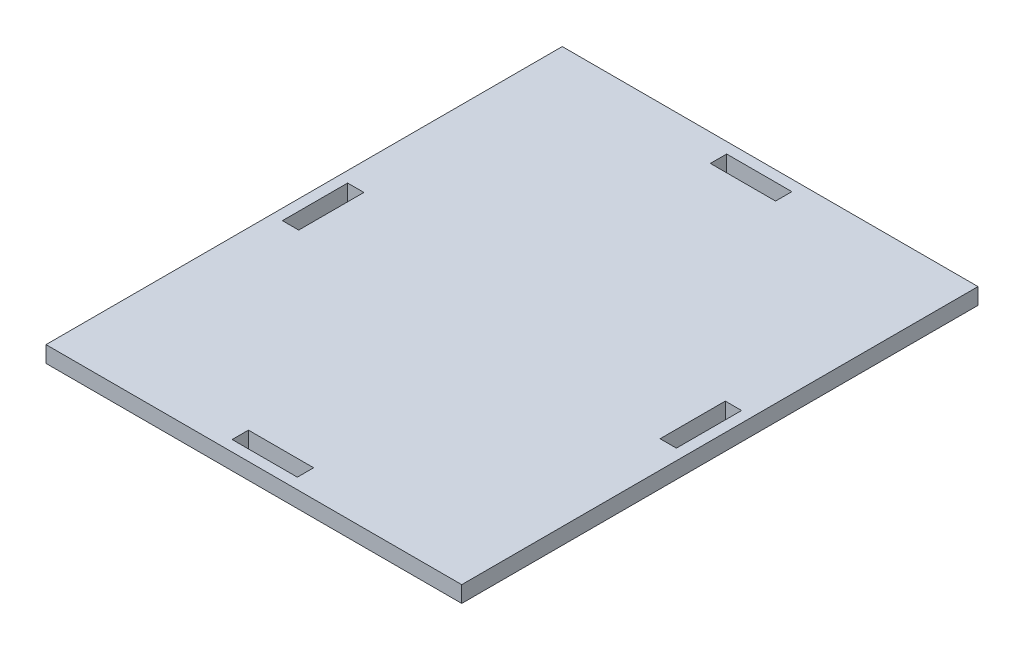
ISO-10303-21;
HEADER;
FILE_DESCRIPTION(('STEP AP214'),'2;1');
FILE_NAME('part.step','',(''),(''),'','','');
FILE_SCHEMA(('AUTOMOTIVE_DESIGN { 1 0 10303 214 1 1 1 1 }'));
ENDSEC;
DATA;
#1=APPLICATION_CONTEXT('core data for automotive mechanical design processes');
#2=APPLICATION_PROTOCOL_DEFINITION('international standard','automotive_design',2000,#1);
#3=PRODUCT_CONTEXT('',#1,'mechanical');
#4=PRODUCT('Part','Part','',(#3));
#5=PRODUCT_RELATED_PRODUCT_CATEGORY('part','',(#4));
#6=PRODUCT_DEFINITION_FORMATION('','',#4);
#7=PRODUCT_DEFINITION_CONTEXT('part definition',#1,'design');
#8=PRODUCT_DEFINITION('design','',#6,#7);
#9=PRODUCT_DEFINITION_SHAPE('','',#8);
#10=(LENGTH_UNIT() NAMED_UNIT(*) SI_UNIT(.MILLI.,.METRE.));
#11=(NAMED_UNIT(*) PLANE_ANGLE_UNIT() SI_UNIT($,.RADIAN.));
#12=(NAMED_UNIT(*) SI_UNIT($,.STERADIAN.) SOLID_ANGLE_UNIT());
#13=UNCERTAINTY_MEASURE_WITH_UNIT(LENGTH_MEASURE(1.E-05),#10,'distance_accuracy_value','');
#14=(GEOMETRIC_REPRESENTATION_CONTEXT(3) GLOBAL_UNCERTAINTY_ASSIGNED_CONTEXT((#13)) GLOBAL_UNIT_ASSIGNED_CONTEXT((#10,
#11,#12)) REPRESENTATION_CONTEXT('',''));
#15=CARTESIAN_POINT('',(0.,0.,0.));
#16=DIRECTION('',(0.,0.,1.));
#17=DIRECTION('',(1.,0.,0.));
#18=AXIS2_PLACEMENT_3D('',#15,#16,#17);
#19=CARTESIAN_POINT('',(0.,3.,-45.5));
#20=DIRECTION('',(0.,0.,-1.));
#21=DIRECTION('',(-1.,0.,0.));
#22=AXIS2_PLACEMENT_3D('',#19,#20,#21);
#23=PLANE('',#22);
#24=DIRECTION('',(1.,0.,0.));
#25=VECTOR('',#24,1.);
#26=CARTESIAN_POINT('',(0.,0.,-45.5));
#27=LINE('',#26,#25);
#28=CARTESIAN_POINT('',(-6.,0.,-45.5));
#29=VERTEX_POINT('',#28);
#30=CARTESIAN_POINT('',(6.,0.,-45.5));
#31=VERTEX_POINT('',#30);
#32=EDGE_CURVE('E250',#29,#31,#27,.T.);
#33=ORIENTED_EDGE('',*,*,#32,.T.);
#34=DIRECTION('',(0.,-1.,0.));
#35=VECTOR('',#34,1.);
#36=CARTESIAN_POINT('',(6.,3.,-45.5));
#37=LINE('',#36,#35);
#38=CARTESIAN_POINT('',(6.,3.,-45.5));
#39=VERTEX_POINT('',#38);
#40=EDGE_CURVE('E11',#39,#31,#37,.T.);
#41=ORIENTED_EDGE('',*,*,#40,.F.);
#42=DIRECTION('',(1.,0.,0.));
#43=VECTOR('',#42,1.);
#44=CARTESIAN_POINT('',(0.,3.,-45.5));
#45=LINE('',#44,#43);
#46=CARTESIAN_POINT('',(-6.,3.,-45.5));
#47=VERTEX_POINT('',#46);
#48=EDGE_CURVE('E186',#47,#39,#45,.T.);
#49=ORIENTED_EDGE('',*,*,#48,.F.);
#50=DIRECTION('',(0.,-1.,0.));
#51=VECTOR('',#50,1.);
#52=CARTESIAN_POINT('',(-6.,3.,-45.5));
#53=LINE('',#52,#51);
#54=EDGE_CURVE('E54',#47,#29,#53,.T.);
#55=ORIENTED_EDGE('',*,*,#54,.T.);
#56=EDGE_LOOP('',(#33,#41,#49,#55));
#57=FACE_BOUND('',#56,.T.);
#58=ADVANCED_FACE('F35',(#57),#23,.F.);
#59=CARTESIAN_POINT('',(6.,3.,0.));
#60=DIRECTION('',(1.,0.,0.));
#61=DIRECTION('',(0.,0.,-1.));
#62=AXIS2_PLACEMENT_3D('',#59,#60,#61);
#63=PLANE('',#62);
#64=DIRECTION('',(0.,0.,1.));
#65=VECTOR('',#64,1.);
#66=CARTESIAN_POINT('',(6.,0.,0.));
#67=LINE('',#66,#65);
#68=CARTESIAN_POINT('',(6.,0.,-42.5));
#69=VERTEX_POINT('',#68);
#70=EDGE_CURVE('E192',#31,#69,#67,.T.);
#71=ORIENTED_EDGE('',*,*,#70,.T.);
#72=DIRECTION('',(0.,-1.,0.));
#73=VECTOR('',#72,1.);
#74=CARTESIAN_POINT('',(6.,3.,-42.5));
#75=LINE('',#74,#73);
#76=CARTESIAN_POINT('',(6.,3.,-42.5));
#77=VERTEX_POINT('',#76);
#78=EDGE_CURVE('E45',#77,#69,#75,.T.);
#79=ORIENTED_EDGE('',*,*,#78,.F.);
#80=DIRECTION('',(0.,0.,1.));
#81=VECTOR('',#80,1.);
#82=CARTESIAN_POINT('',(6.,3.,0.));
#83=LINE('',#82,#81);
#84=EDGE_CURVE('E180',#39,#77,#83,.T.);
#85=ORIENTED_EDGE('',*,*,#84,.F.);
#86=ORIENTED_EDGE('',*,*,#40,.T.);
#87=EDGE_LOOP('',(#71,#79,#85,#86));
#88=FACE_BOUND('',#87,.T.);
#89=ADVANCED_FACE('F191',(#88),#63,.F.);
#90=CARTESIAN_POINT('',(0.,3.,-42.5));
#91=DIRECTION('',(0.,0.,-1.));
#92=DIRECTION('',(-1.,0.,0.));
#93=AXIS2_PLACEMENT_3D('',#90,#91,#92);
#94=PLANE('',#93);
#95=DIRECTION('',(1.,0.,0.));
#96=VECTOR('',#95,1.);
#97=CARTESIAN_POINT('',(0.,0.,-42.5));
#98=LINE('',#97,#96);
#99=CARTESIAN_POINT('',(-6.,0.,-42.5));
#100=VERTEX_POINT('',#99);
#101=EDGE_CURVE('E253',#100,#69,#98,.T.);
#102=ORIENTED_EDGE('',*,*,#101,.F.);
#103=DIRECTION('',(0.,-1.,0.));
#104=VECTOR('',#103,1.);
#105=CARTESIAN_POINT('',(-6.,3.,-42.5));
#106=LINE('',#105,#104);
#107=CARTESIAN_POINT('',(-6.,3.,-42.5));
#108=VERTEX_POINT('',#107);
#109=EDGE_CURVE('E116',#108,#100,#106,.T.);
#110=ORIENTED_EDGE('',*,*,#109,.F.);
#111=DIRECTION('',(1.,0.,0.));
#112=VECTOR('',#111,1.);
#113=CARTESIAN_POINT('',(0.,3.,-42.5));
#114=LINE('',#113,#112);
#115=EDGE_CURVE('E185',#108,#77,#114,.T.);
#116=ORIENTED_EDGE('',*,*,#115,.T.);
#117=ORIENTED_EDGE('',*,*,#78,.T.);
#118=EDGE_LOOP('',(#102,#110,#116,#117));
#119=FACE_BOUND('',#118,.T.);
#120=ADVANCED_FACE('F196',(#119),#94,.T.);
#121=CARTESIAN_POINT('',(0.,3.,45.5));
#122=DIRECTION('',(0.,0.,-1.));
#123=DIRECTION('',(-1.,0.,0.));
#124=AXIS2_PLACEMENT_3D('',#121,#122,#123);
#125=PLANE('',#124);
#126=DIRECTION('',(1.,0.,0.));
#127=VECTOR('',#126,1.);
#128=CARTESIAN_POINT('',(0.,0.,45.5));
#129=LINE('',#128,#127);
#130=CARTESIAN_POINT('',(-5.99999999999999,0.,45.5));
#131=VERTEX_POINT('',#130);
#132=CARTESIAN_POINT('',(6.00000000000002,0.,45.5));
#133=VERTEX_POINT('',#132);
#134=EDGE_CURVE('E238',#131,#133,#129,.T.);
#135=ORIENTED_EDGE('',*,*,#134,.F.);
#136=DIRECTION('',(0.,-1.,0.));
#137=VECTOR('',#136,1.);
#138=CARTESIAN_POINT('',(-5.99999999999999,3.,45.5));
#139=LINE('',#138,#137);
#140=CARTESIAN_POINT('',(-5.99999999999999,3.,45.5));
#141=VERTEX_POINT('',#140);
#142=EDGE_CURVE('E260',#141,#131,#139,.T.);
#143=ORIENTED_EDGE('',*,*,#142,.F.);
#144=DIRECTION('',(1.,0.,0.));
#145=VECTOR('',#144,1.);
#146=CARTESIAN_POINT('',(0.,3.,45.5));
#147=LINE('',#146,#145);
#148=CARTESIAN_POINT('',(6.00000000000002,3.,45.5));
#149=VERTEX_POINT('',#148);
#150=EDGE_CURVE('E587',#141,#149,#147,.T.);
#151=ORIENTED_EDGE('',*,*,#150,.T.);
#152=DIRECTION('',(0.,-1.,0.));
#153=VECTOR('',#152,1.);
#154=CARTESIAN_POINT('',(6.00000000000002,3.,45.5));
#155=LINE('',#154,#153);
#156=EDGE_CURVE('E262',#149,#133,#155,.T.);
#157=ORIENTED_EDGE('',*,*,#156,.T.);
#158=EDGE_LOOP('',(#135,#143,#151,#157));
#159=FACE_BOUND('',#158,.T.);
#160=ADVANCED_FACE('F338',(#159),#125,.T.);
#161=CARTESIAN_POINT('',(-5.99999999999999,3.,0.));
#162=DIRECTION('',(-1.,0.,0.));
#163=DIRECTION('',(0.,0.,1.));
#164=AXIS2_PLACEMENT_3D('',#161,#162,#163);
#165=PLANE('',#164);
#166=DIRECTION('',(0.,0.,-1.));
#167=VECTOR('',#166,1.);
#168=CARTESIAN_POINT('',(-5.99999999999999,0.,0.));
#169=LINE('',#168,#167);
#170=CARTESIAN_POINT('',(-5.99999999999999,0.,42.5));
#171=VERTEX_POINT('',#170);
#172=EDGE_CURVE('E241',#131,#171,#169,.T.);
#173=ORIENTED_EDGE('',*,*,#172,.T.);
#174=DIRECTION('',(0.,-1.,0.));
#175=VECTOR('',#174,1.);
#176=CARTESIAN_POINT('',(-5.99999999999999,3.,42.5));
#177=LINE('',#176,#175);
#178=CARTESIAN_POINT('',(-5.99999999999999,3.,42.5));
#179=VERTEX_POINT('',#178);
#180=EDGE_CURVE('E267',#179,#171,#177,.T.);
#181=ORIENTED_EDGE('',*,*,#180,.F.);
#182=DIRECTION('',(0.,0.,-1.));
#183=VECTOR('',#182,1.);
#184=CARTESIAN_POINT('',(-5.99999999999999,3.,0.));
#185=LINE('',#184,#183);
#186=EDGE_CURVE('E584',#141,#179,#185,.T.);
#187=ORIENTED_EDGE('',*,*,#186,.F.);
#188=ORIENTED_EDGE('',*,*,#142,.T.);
#189=EDGE_LOOP('',(#173,#181,#187,#188));
#190=FACE_BOUND('',#189,.T.);
#191=ADVANCED_FACE('F334',(#190),#165,.F.);
#192=CARTESIAN_POINT('',(0.,3.,42.5));
#193=DIRECTION('',(0.,0.,-1.));
#194=DIRECTION('',(-1.,0.,0.));
#195=AXIS2_PLACEMENT_3D('',#192,#193,#194);
#196=PLANE('',#195);
#197=DIRECTION('',(1.,0.,0.));
#198=VECTOR('',#197,1.);
#199=CARTESIAN_POINT('',(0.,0.,42.5));
#200=LINE('',#199,#198);
#201=CARTESIAN_POINT('',(6.00000000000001,0.,42.5));
#202=VERTEX_POINT('',#201);
#203=EDGE_CURVE('E244',#171,#202,#200,.T.);
#204=ORIENTED_EDGE('',*,*,#203,.T.);
#205=DIRECTION('',(0.,-1.,0.));
#206=VECTOR('',#205,1.);
#207=CARTESIAN_POINT('',(6.00000000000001,3.,42.5));
#208=LINE('',#207,#206);
#209=CARTESIAN_POINT('',(6.00000000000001,3.,42.5));
#210=VERTEX_POINT('',#209);
#211=EDGE_CURVE('E264',#210,#202,#208,.T.);
#212=ORIENTED_EDGE('',*,*,#211,.F.);
#213=DIRECTION('',(1.,0.,0.));
#214=VECTOR('',#213,1.);
#215=CARTESIAN_POINT('',(0.,3.,42.5));
#216=LINE('',#215,#214);
#217=EDGE_CURVE('E580',#179,#210,#216,.T.);
#218=ORIENTED_EDGE('',*,*,#217,.F.);
#219=ORIENTED_EDGE('',*,*,#180,.T.);
#220=EDGE_LOOP('',(#204,#212,#218,#219));
#221=FACE_BOUND('',#220,.T.);
#222=ADVANCED_FACE('F330',(#221),#196,.F.);
#223=CARTESIAN_POINT('',(-36.2500000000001,3.,1.25767452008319E-13));
#224=DIRECTION('',(1.,0.,0.));
#225=DIRECTION('',(0.,0.,-1.));
#226=AXIS2_PLACEMENT_3D('',#223,#224,#225);
#227=PLANE('',#226);
#228=DIRECTION('',(0.,0.,1.));
#229=VECTOR('',#228,1.);
#230=CARTESIAN_POINT('',(-36.2500000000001,0.,1.25767452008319E-13));
#231=LINE('',#230,#229);
#232=CARTESIAN_POINT('',(-36.2500000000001,0.,-5.99999999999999));
#233=VERTEX_POINT('',#232);
#234=CARTESIAN_POINT('',(-36.2500000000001,0.,6.00000000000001));
#235=VERTEX_POINT('',#234);
#236=EDGE_CURVE('E226',#233,#235,#231,.T.);
#237=ORIENTED_EDGE('',*,*,#236,.F.);
#238=DIRECTION('',(0.,-1.,0.));
#239=VECTOR('',#238,1.);
#240=CARTESIAN_POINT('',(-36.2500000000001,3.,-5.99999999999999));
#241=LINE('',#240,#239);
#242=CARTESIAN_POINT('',(-36.2500000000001,3.,-5.99999999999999));
#243=VERTEX_POINT('',#242);
#244=EDGE_CURVE('E265',#243,#233,#241,.T.);
#245=ORIENTED_EDGE('',*,*,#244,.F.);
#246=DIRECTION('',(0.,0.,1.));
#247=VECTOR('',#246,1.);
#248=CARTESIAN_POINT('',(-36.2500000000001,3.,1.25767452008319E-13));
#249=LINE('',#248,#247);
#250=CARTESIAN_POINT('',(-36.2500000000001,3.,6.00000000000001));
#251=VERTEX_POINT('',#250);
#252=EDGE_CURVE('E598',#243,#251,#249,.T.);
#253=ORIENTED_EDGE('',*,*,#252,.T.);
#254=DIRECTION('',(0.,-1.,0.));
#255=VECTOR('',#254,1.);
#256=CARTESIAN_POINT('',(-36.2500000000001,3.,6.00000000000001));
#257=LINE('',#256,#255);
#258=EDGE_CURVE('E271',#251,#235,#257,.T.);
#259=ORIENTED_EDGE('',*,*,#258,.T.);
#260=EDGE_LOOP('',(#237,#245,#253,#259));
#261=FACE_BOUND('',#260,.T.);
#262=ADVANCED_FACE('F333',(#261),#227,.T.);
#263=CARTESIAN_POINT('',(0.,3.,-5.99999999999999));
#264=DIRECTION('',(0.,0.,-1.));
#265=DIRECTION('',(-1.,0.,0.));
#266=AXIS2_PLACEMENT_3D('',#263,#264,#265);
#267=PLANE('',#266);
#268=DIRECTION('',(1.,0.,0.));
#269=VECTOR('',#268,1.);
#270=CARTESIAN_POINT('',(0.,0.,-5.99999999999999));
#271=LINE('',#270,#269);
#272=CARTESIAN_POINT('',(-33.25,0.,-5.99999999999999));
#273=VERTEX_POINT('',#272);
#274=EDGE_CURVE('E229',#233,#273,#271,.T.);
#275=ORIENTED_EDGE('',*,*,#274,.T.);
#276=DIRECTION('',(0.,-1.,0.));
#277=VECTOR('',#276,1.);
#278=CARTESIAN_POINT('',(-33.25,3.,-5.99999999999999));
#279=LINE('',#278,#277);
#280=CARTESIAN_POINT('',(-33.25,3.,-5.99999999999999));
#281=VERTEX_POINT('',#280);
#282=EDGE_CURVE('E276',#281,#273,#279,.T.);
#283=ORIENTED_EDGE('',*,*,#282,.F.);
#284=DIRECTION('',(1.,0.,0.));
#285=VECTOR('',#284,1.);
#286=CARTESIAN_POINT('',(0.,3.,-5.99999999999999));
#287=LINE('',#286,#285);
#288=EDGE_CURVE('E595',#243,#281,#287,.T.);
#289=ORIENTED_EDGE('',*,*,#288,.F.);
#290=ORIENTED_EDGE('',*,*,#244,.T.);
#291=EDGE_LOOP('',(#275,#283,#289,#290));
#292=FACE_BOUND('',#291,.T.);
#293=ADVANCED_FACE('F351',(#292),#267,.F.);
#294=CARTESIAN_POINT('',(-33.25,3.,0.));
#295=DIRECTION('',(1.,0.,0.));
#296=DIRECTION('',(0.,0.,-1.));
#297=AXIS2_PLACEMENT_3D('',#294,#295,#296);
#298=PLANE('',#297);
#299=DIRECTION('',(0.,0.,1.));
#300=VECTOR('',#299,1.);
#301=CARTESIAN_POINT('',(-33.25,0.,0.));
#302=LINE('',#301,#300);
#303=CARTESIAN_POINT('',(-33.25,0.,6.00000000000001));
#304=VERTEX_POINT('',#303);
#305=EDGE_CURVE('E232',#273,#304,#302,.T.);
#306=ORIENTED_EDGE('',*,*,#305,.T.);
#307=DIRECTION('',(0.,-1.,0.));
#308=VECTOR('',#307,1.);
#309=CARTESIAN_POINT('',(-33.25,3.,6.00000000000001));
#310=LINE('',#309,#308);
#311=CARTESIAN_POINT('',(-33.25,3.,6.00000000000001));
#312=VERTEX_POINT('',#311);
#313=EDGE_CURVE('E273',#312,#304,#310,.T.);
#314=ORIENTED_EDGE('',*,*,#313,.F.);
#315=DIRECTION('',(0.,0.,1.));
#316=VECTOR('',#315,1.);
#317=CARTESIAN_POINT('',(-33.25,3.,0.));
#318=LINE('',#317,#316);
#319=EDGE_CURVE('E593',#281,#312,#318,.T.);
#320=ORIENTED_EDGE('',*,*,#319,.F.);
#321=ORIENTED_EDGE('',*,*,#282,.T.);
#322=EDGE_LOOP('',(#306,#314,#320,#321));
#323=FACE_BOUND('',#322,.T.);
#324=ADVANCED_FACE('F347',(#323),#298,.F.);
#325=CARTESIAN_POINT('',(0.,3.,-5.99999999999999));
#326=DIRECTION('',(0.,0.,1.));
#327=DIRECTION('',(1.,0.,0.));
#328=AXIS2_PLACEMENT_3D('',#325,#326,#327);
#329=PLANE('',#328);
#330=DIRECTION('',(-1.,0.,0.));
#331=VECTOR('',#330,1.);
#332=CARTESIAN_POINT('',(0.,0.,-5.99999999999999));
#333=LINE('',#332,#331);
#334=CARTESIAN_POINT('',(36.2499999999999,0.,-5.99999999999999));
#335=VERTEX_POINT('',#334);
#336=CARTESIAN_POINT('',(33.25,0.,-5.99999999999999));
#337=VERTEX_POINT('',#336);
#338=EDGE_CURVE('E214',#335,#337,#333,.T.);
#339=ORIENTED_EDGE('',*,*,#338,.F.);
#340=DIRECTION('',(0.,-1.,0.));
#341=VECTOR('',#340,1.);
#342=CARTESIAN_POINT('',(36.2499999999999,3.,-5.99999999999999));
#343=LINE('',#342,#341);
#344=CARTESIAN_POINT('',(36.2499999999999,3.,-5.99999999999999));
#345=VERTEX_POINT('',#344);
#346=EDGE_CURVE('E274',#345,#335,#343,.T.);
#347=ORIENTED_EDGE('',*,*,#346,.F.);
#348=DIRECTION('',(-1.,0.,0.));
#349=VECTOR('',#348,1.);
#350=CARTESIAN_POINT('',(0.,3.,-5.99999999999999));
#351=LINE('',#350,#349);
#352=CARTESIAN_POINT('',(33.25,3.,-5.99999999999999));
#353=VERTEX_POINT('',#352);
#354=EDGE_CURVE('E609',#345,#353,#351,.T.);
#355=ORIENTED_EDGE('',*,*,#354,.T.);
#356=DIRECTION('',(0.,-1.,0.));
#357=VECTOR('',#356,1.);
#358=CARTESIAN_POINT('',(33.25,3.,-5.99999999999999));
#359=LINE('',#358,#357);
#360=EDGE_CURVE('E280',#353,#337,#359,.T.);
#361=ORIENTED_EDGE('',*,*,#360,.T.);
#362=EDGE_LOOP('',(#339,#347,#355,#361));
#363=FACE_BOUND('',#362,.T.);
#364=ADVANCED_FACE('F350',(#363),#329,.T.);
#365=CARTESIAN_POINT('',(36.2499999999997,3.,2.51534904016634E-13));
#366=DIRECTION('',(-1.,0.,0.));
#367=DIRECTION('',(0.,0.,1.));
#368=AXIS2_PLACEMENT_3D('',#365,#366,#367);
#369=PLANE('',#368);
#370=DIRECTION('',(0.,0.,-1.));
#371=VECTOR('',#370,1.);
#372=CARTESIAN_POINT('',(36.2499999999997,0.,2.51534904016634E-13));
#373=LINE('',#372,#371);
#374=CARTESIAN_POINT('',(36.2499999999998,0.,6.00000000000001));
#375=VERTEX_POINT('',#374);
#376=EDGE_CURVE('E217',#375,#335,#373,.T.);
#377=ORIENTED_EDGE('',*,*,#376,.F.);
#378=DIRECTION('',(0.,-1.,0.));
#379=VECTOR('',#378,1.);
#380=CARTESIAN_POINT('',(36.2499999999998,3.,6.00000000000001));
#381=LINE('',#380,#379);
#382=CARTESIAN_POINT('',(36.2499999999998,3.,6.00000000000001));
#383=VERTEX_POINT('',#382);
#384=EDGE_CURVE('E284',#383,#375,#381,.T.);
#385=ORIENTED_EDGE('',*,*,#384,.F.);
#386=DIRECTION('',(0.,0.,-1.));
#387=VECTOR('',#386,1.);
#388=CARTESIAN_POINT('',(36.2499999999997,3.,2.51534904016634E-13));
#389=LINE('',#388,#387);
#390=EDGE_CURVE('E606',#383,#345,#389,.T.);
#391=ORIENTED_EDGE('',*,*,#390,.T.);
#392=ORIENTED_EDGE('',*,*,#346,.T.);
#393=EDGE_LOOP('',(#377,#385,#391,#392));
#394=FACE_BOUND('',#393,.T.);
#395=ADVANCED_FACE('F365',(#394),#369,.T.);
#396=CARTESIAN_POINT('',(0.,3.,5.99999999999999));
#397=DIRECTION('',(0.,0.,1.));
#398=DIRECTION('',(1.,0.,0.));
#399=AXIS2_PLACEMENT_3D('',#396,#397,#398);
#400=PLANE('',#399);
#401=DIRECTION('',(-1.,0.,0.));
#402=VECTOR('',#401,1.);
#403=CARTESIAN_POINT('',(0.,0.,5.99999999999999));
#404=LINE('',#403,#402);
#405=CARTESIAN_POINT('',(33.25,0.,6.00000000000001));
#406=VERTEX_POINT('',#405);
#407=EDGE_CURVE('E220',#375,#406,#404,.T.);
#408=ORIENTED_EDGE('',*,*,#407,.T.);
#409=DIRECTION('',(0.,-1.,0.));
#410=VECTOR('',#409,1.);
#411=CARTESIAN_POINT('',(33.25,3.,6.00000000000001));
#412=LINE('',#411,#410);
#413=CARTESIAN_POINT('',(33.25,3.,6.00000000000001));
#414=VERTEX_POINT('',#413);
#415=EDGE_CURVE('E282',#414,#406,#412,.T.);
#416=ORIENTED_EDGE('',*,*,#415,.F.);
#417=DIRECTION('',(-1.,0.,0.));
#418=VECTOR('',#417,1.);
#419=CARTESIAN_POINT('',(0.,3.,5.99999999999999));
#420=LINE('',#419,#418);
#421=EDGE_CURVE('E604',#383,#414,#420,.T.);
#422=ORIENTED_EDGE('',*,*,#421,.F.);
#423=ORIENTED_EDGE('',*,*,#384,.T.);
#424=EDGE_LOOP('',(#408,#416,#422,#423));
#425=FACE_BOUND('',#424,.T.);
#426=ADVANCED_FACE('F362',(#425),#400,.F.);
#427=CARTESIAN_POINT('',(0.,3.,-47.5));
#428=DIRECTION('',(0.,0.,-1.));
#429=DIRECTION('',(-1.,0.,0.));
#430=AXIS2_PLACEMENT_3D('',#427,#428,#429);
#431=PLANE('',#430);
#432=DIRECTION('',(1.,0.,0.));
#433=VECTOR('',#432,1.);
#434=CARTESIAN_POINT('',(0.,0.,-47.5));
#435=LINE('',#434,#433);
#436=CARTESIAN_POINT('',(-38.25,0.,-47.5));
#437=VERTEX_POINT('',#436);
#438=CARTESIAN_POINT('',(38.25,0.,-47.5));
#439=VERTEX_POINT('',#438);
#440=EDGE_CURVE('E203',#437,#439,#435,.T.);
#441=ORIENTED_EDGE('',*,*,#440,.F.);
#442=DIRECTION('',(0.,-1.,0.));
#443=VECTOR('',#442,1.);
#444=CARTESIAN_POINT('',(-38.25,3.,-47.5));
#445=LINE('',#444,#443);
#446=CARTESIAN_POINT('',(-38.25,3.,-47.5));
#447=VERTEX_POINT('',#446);
#448=EDGE_CURVE('E39',#447,#437,#445,.T.);
#449=ORIENTED_EDGE('',*,*,#448,.F.);
#450=DIRECTION('',(1.,0.,0.));
#451=VECTOR('',#450,1.);
#452=CARTESIAN_POINT('',(0.,3.,-47.5));
#453=LINE('',#452,#451);
#454=CARTESIAN_POINT('',(38.25,3.,-47.5));
#455=VERTEX_POINT('',#454);
#456=EDGE_CURVE('E258',#447,#455,#453,.T.);
#457=ORIENTED_EDGE('',*,*,#456,.T.);
#458=DIRECTION('',(0.,-1.,0.));
#459=VECTOR('',#458,1.);
#460=CARTESIAN_POINT('',(38.25,3.,-47.5));
#461=LINE('',#460,#459);
#462=EDGE_CURVE('E199',#455,#439,#461,.T.);
#463=ORIENTED_EDGE('',*,*,#462,.T.);
#464=EDGE_LOOP('',(#441,#449,#457,#463));
#465=FACE_BOUND('',#464,.T.);
#466=ADVANCED_FACE('F37',(#465),#431,.T.);
#467=CARTESIAN_POINT('',(-38.25,3.,0.));
#468=DIRECTION('',(1.,0.,0.));
#469=DIRECTION('',(0.,0.,-1.));
#470=AXIS2_PLACEMENT_3D('',#467,#468,#469);
#471=PLANE('',#470);
#472=DIRECTION('',(0.,0.,1.));
#473=VECTOR('',#472,1.);
#474=CARTESIAN_POINT('',(-38.25,0.,0.));
#475=LINE('',#474,#473);
#476=CARTESIAN_POINT('',(-38.25,0.,47.5));
#477=VERTEX_POINT('',#476);
#478=EDGE_CURVE('E206',#437,#477,#475,.T.);
#479=ORIENTED_EDGE('',*,*,#478,.T.);
#480=DIRECTION('',(0.,-1.,0.));
#481=VECTOR('',#480,1.);
#482=CARTESIAN_POINT('',(-38.25,3.,47.5));
#483=LINE('',#482,#481);
#484=CARTESIAN_POINT('',(-38.25,3.,47.5));
#485=VERTEX_POINT('',#484);
#486=EDGE_CURVE('E289',#485,#477,#483,.T.);
#487=ORIENTED_EDGE('',*,*,#486,.F.);
#488=DIRECTION('',(0.,0.,1.));
#489=VECTOR('',#488,1.);
#490=CARTESIAN_POINT('',(-38.25,3.,0.));
#491=LINE('',#490,#489);
#492=EDGE_CURVE('E298',#447,#485,#491,.T.);
#493=ORIENTED_EDGE('',*,*,#492,.F.);
#494=ORIENTED_EDGE('',*,*,#448,.T.);
#495=EDGE_LOOP('',(#479,#487,#493,#494));
#496=FACE_BOUND('',#495,.T.);
#497=ADVANCED_FACE('F297',(#496),#471,.F.);
#498=CARTESIAN_POINT('',(0.,3.,47.5));
#499=DIRECTION('',(0.,0.,-1.));
#500=DIRECTION('',(-1.,0.,0.));
#501=AXIS2_PLACEMENT_3D('',#498,#499,#500);
#502=PLANE('',#501);
#503=DIRECTION('',(1.,0.,0.));
#504=VECTOR('',#503,1.);
#505=CARTESIAN_POINT('',(0.,0.,47.5));
#506=LINE('',#505,#504);
#507=CARTESIAN_POINT('',(38.25,0.,47.5));
#508=VERTEX_POINT('',#507);
#509=EDGE_CURVE('E208',#477,#508,#506,.T.);
#510=ORIENTED_EDGE('',*,*,#509,.T.);
#511=DIRECTION('',(0.,-1.,0.));
#512=VECTOR('',#511,1.);
#513=CARTESIAN_POINT('',(38.25,3.,47.5));
#514=LINE('',#513,#512);
#515=CARTESIAN_POINT('',(38.25,3.,47.5));
#516=VERTEX_POINT('',#515);
#517=EDGE_CURVE('E288',#516,#508,#514,.T.);
#518=ORIENTED_EDGE('',*,*,#517,.F.);
#519=DIRECTION('',(1.,0.,0.));
#520=VECTOR('',#519,1.);
#521=CARTESIAN_POINT('',(0.,3.,47.5));
#522=LINE('',#521,#520);
#523=EDGE_CURVE('E613',#485,#516,#522,.T.);
#524=ORIENTED_EDGE('',*,*,#523,.F.);
#525=ORIENTED_EDGE('',*,*,#486,.T.);
#526=EDGE_LOOP('',(#510,#518,#524,#525));
#527=FACE_BOUND('',#526,.T.);
#528=ADVANCED_FACE('F310',(#527),#502,.F.);
#529=CARTESIAN_POINT('',(5.99999999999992,3.,0.));
#530=DIRECTION('',(-1.,0.,0.));
#531=DIRECTION('',(0.,0.,1.));
#532=AXIS2_PLACEMENT_3D('',#529,#530,#531);
#533=PLANE('',#532);
#534=DIRECTION('',(0.,0.,-1.));
#535=VECTOR('',#534,1.);
#536=CARTESIAN_POINT('',(5.99999999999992,0.,0.));
#537=LINE('',#536,#535);
#538=EDGE_CURVE('E247',#133,#202,#537,.T.);
#539=ORIENTED_EDGE('',*,*,#538,.F.);
#540=ORIENTED_EDGE('',*,*,#156,.F.);
#541=DIRECTION('',(0.,0.,-1.));
#542=VECTOR('',#541,1.);
#543=CARTESIAN_POINT('',(5.99999999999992,3.,0.));
#544=LINE('',#543,#542);
#545=EDGE_CURVE('E578',#149,#210,#544,.T.);
#546=ORIENTED_EDGE('',*,*,#545,.T.);
#547=ORIENTED_EDGE('',*,*,#211,.T.);
#548=EDGE_LOOP('',(#539,#540,#546,#547));
#549=FACE_BOUND('',#548,.T.);
#550=ADVANCED_FACE('F312',(#549),#533,.T.);
#551=CARTESIAN_POINT('',(0.,3.,5.99999999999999));
#552=DIRECTION('',(0.,0.,-1.));
#553=DIRECTION('',(-1.,0.,0.));
#554=AXIS2_PLACEMENT_3D('',#551,#552,#553);
#555=PLANE('',#554);
#556=DIRECTION('',(1.,0.,0.));
#557=VECTOR('',#556,1.);
#558=CARTESIAN_POINT('',(0.,0.,5.99999999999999));
#559=LINE('',#558,#557);
#560=EDGE_CURVE('E235',#235,#304,#559,.T.);
#561=ORIENTED_EDGE('',*,*,#560,.F.);
#562=ORIENTED_EDGE('',*,*,#258,.F.);
#563=DIRECTION('',(1.,0.,0.));
#564=VECTOR('',#563,1.);
#565=CARTESIAN_POINT('',(0.,3.,5.99999999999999));
#566=LINE('',#565,#564);
#567=EDGE_CURVE('E590',#251,#312,#566,.T.);
#568=ORIENTED_EDGE('',*,*,#567,.T.);
#569=ORIENTED_EDGE('',*,*,#313,.T.);
#570=EDGE_LOOP('',(#561,#562,#568,#569));
#571=FACE_BOUND('',#570,.T.);
#572=ADVANCED_FACE('F318',(#571),#555,.T.);
#573=CARTESIAN_POINT('',(33.25,3.,0.));
#574=DIRECTION('',(1.,0.,0.));
#575=DIRECTION('',(0.,0.,-1.));
#576=AXIS2_PLACEMENT_3D('',#573,#574,#575);
#577=PLANE('',#576);
#578=DIRECTION('',(0.,0.,1.));
#579=VECTOR('',#578,1.);
#580=CARTESIAN_POINT('',(33.25,0.,0.));
#581=LINE('',#580,#579);
#582=EDGE_CURVE('E223',#337,#406,#581,.T.);
#583=ORIENTED_EDGE('',*,*,#582,.F.);
#584=ORIENTED_EDGE('',*,*,#360,.F.);
#585=DIRECTION('',(0.,0.,1.));
#586=VECTOR('',#585,1.);
#587=CARTESIAN_POINT('',(33.25,3.,0.));
#588=LINE('',#587,#586);
#589=EDGE_CURVE('E601',#353,#414,#588,.T.);
#590=ORIENTED_EDGE('',*,*,#589,.T.);
#591=ORIENTED_EDGE('',*,*,#415,.T.);
#592=EDGE_LOOP('',(#583,#584,#590,#591));
#593=FACE_BOUND('',#592,.T.);
#594=ADVANCED_FACE('F345',(#593),#577,.T.);
#595=CARTESIAN_POINT('',(38.25,3.,0.));
#596=DIRECTION('',(1.,0.,0.));
#597=DIRECTION('',(0.,0.,-1.));
#598=AXIS2_PLACEMENT_3D('',#595,#596,#597);
#599=PLANE('',#598);
#600=DIRECTION('',(0.,0.,1.));
#601=VECTOR('',#600,1.);
#602=CARTESIAN_POINT('',(38.25,0.,0.));
#603=LINE('',#602,#601);
#604=EDGE_CURVE('E211',#439,#508,#603,.T.);
#605=ORIENTED_EDGE('',*,*,#604,.F.);
#606=ORIENTED_EDGE('',*,*,#462,.F.);
#607=DIRECTION('',(0.,0.,1.));
#608=VECTOR('',#607,1.);
#609=CARTESIAN_POINT('',(38.25,3.,0.));
#610=LINE('',#609,#608);
#611=EDGE_CURVE('E308',#455,#516,#610,.T.);
#612=ORIENTED_EDGE('',*,*,#611,.T.);
#613=ORIENTED_EDGE('',*,*,#517,.T.);
#614=EDGE_LOOP('',(#605,#606,#612,#613));
#615=FACE_BOUND('',#614,.T.);
#616=ADVANCED_FACE('F307',(#615),#599,.T.);
#617=CARTESIAN_POINT('',(-6.,3.,0.));
#618=DIRECTION('',(1.,0.,0.));
#619=DIRECTION('',(0.,0.,-1.));
#620=AXIS2_PLACEMENT_3D('',#617,#618,#619);
#621=PLANE('',#620);
#622=DIRECTION('',(0.,0.,1.));
#623=VECTOR('',#622,1.);
#624=CARTESIAN_POINT('',(-6.,0.,0.));
#625=LINE('',#624,#623);
#626=EDGE_CURVE('E255',#29,#100,#625,.T.);
#627=ORIENTED_EDGE('',*,*,#626,.F.);
#628=ORIENTED_EDGE('',*,*,#54,.F.);
#629=DIRECTION('',(0.,0.,1.));
#630=VECTOR('',#629,1.);
#631=CARTESIAN_POINT('',(-6.,3.,0.));
#632=LINE('',#631,#630);
#633=EDGE_CURVE('E197',#47,#108,#632,.T.);
#634=ORIENTED_EDGE('',*,*,#633,.T.);
#635=ORIENTED_EDGE('',*,*,#109,.T.);
#636=EDGE_LOOP('',(#627,#628,#634,#635));
#637=FACE_BOUND('',#636,.T.);
#638=ADVANCED_FACE('F373',(#637),#621,.T.);
#639=CARTESIAN_POINT('',(0.,3.,0.));
#640=DIRECTION('',(0.,1.,0.));
#641=DIRECTION('',(0.,0.,1.));
#642=AXIS2_PLACEMENT_3D('',#639,#640,#641);
#643=PLANE('',#642);
#644=ORIENTED_EDGE('',*,*,#456,.F.);
#645=ORIENTED_EDGE('',*,*,#492,.T.);
#646=ORIENTED_EDGE('',*,*,#523,.T.);
#647=ORIENTED_EDGE('',*,*,#611,.F.);
#648=EDGE_LOOP('',(#644,#645,#646,#647));
#649=FACE_BOUND('',#648,.T.);
#650=ORIENTED_EDGE('',*,*,#354,.F.);
#651=ORIENTED_EDGE('',*,*,#390,.F.);
#652=ORIENTED_EDGE('',*,*,#421,.T.);
#653=ORIENTED_EDGE('',*,*,#589,.F.);
#654=EDGE_LOOP('',(#650,#651,#652,#653));
#655=FACE_BOUND('',#654,.T.);
#656=ORIENTED_EDGE('',*,*,#252,.F.);
#657=ORIENTED_EDGE('',*,*,#288,.T.);
#658=ORIENTED_EDGE('',*,*,#319,.T.);
#659=ORIENTED_EDGE('',*,*,#567,.F.);
#660=EDGE_LOOP('',(#656,#657,#658,#659));
#661=FACE_BOUND('',#660,.T.);
#662=ORIENTED_EDGE('',*,*,#150,.F.);
#663=ORIENTED_EDGE('',*,*,#186,.T.);
#664=ORIENTED_EDGE('',*,*,#217,.T.);
#665=ORIENTED_EDGE('',*,*,#545,.F.);
#666=EDGE_LOOP('',(#662,#663,#664,#665));
#667=FACE_BOUND('',#666,.T.);
#668=ORIENTED_EDGE('',*,*,#48,.T.);
#669=ORIENTED_EDGE('',*,*,#84,.T.);
#670=ORIENTED_EDGE('',*,*,#115,.F.);
#671=ORIENTED_EDGE('',*,*,#633,.F.);
#672=EDGE_LOOP('',(#668,#669,#670,#671));
#673=FACE_BOUND('',#672,.T.);
#674=ADVANCED_FACE('F182',(#649,#655,#661,#667,#673),#643,.T.);
#675=CARTESIAN_POINT('',(0.,0.,0.));
#676=DIRECTION('',(0.,1.,0.));
#677=DIRECTION('',(0.,0.,1.));
#678=AXIS2_PLACEMENT_3D('',#675,#676,#677);
#679=PLANE('',#678);
#680=ORIENTED_EDGE('',*,*,#440,.T.);
#681=ORIENTED_EDGE('',*,*,#604,.T.);
#682=ORIENTED_EDGE('',*,*,#509,.F.);
#683=ORIENTED_EDGE('',*,*,#478,.F.);
#684=EDGE_LOOP('',(#680,#681,#682,#683));
#685=FACE_BOUND('',#684,.T.);
#686=ORIENTED_EDGE('',*,*,#338,.T.);
#687=ORIENTED_EDGE('',*,*,#582,.T.);
#688=ORIENTED_EDGE('',*,*,#407,.F.);
#689=ORIENTED_EDGE('',*,*,#376,.T.);
#690=EDGE_LOOP('',(#686,#687,#688,#689));
#691=FACE_BOUND('',#690,.T.);
#692=ORIENTED_EDGE('',*,*,#236,.T.);
#693=ORIENTED_EDGE('',*,*,#560,.T.);
#694=ORIENTED_EDGE('',*,*,#305,.F.);
#695=ORIENTED_EDGE('',*,*,#274,.F.);
#696=EDGE_LOOP('',(#692,#693,#694,#695));
#697=FACE_BOUND('',#696,.T.);
#698=ORIENTED_EDGE('',*,*,#134,.T.);
#699=ORIENTED_EDGE('',*,*,#538,.T.);
#700=ORIENTED_EDGE('',*,*,#203,.F.);
#701=ORIENTED_EDGE('',*,*,#172,.F.);
#702=EDGE_LOOP('',(#698,#699,#700,#701));
#703=FACE_BOUND('',#702,.T.);
#704=ORIENTED_EDGE('',*,*,#32,.F.);
#705=ORIENTED_EDGE('',*,*,#626,.T.);
#706=ORIENTED_EDGE('',*,*,#101,.T.);
#707=ORIENTED_EDGE('',*,*,#70,.F.);
#708=EDGE_LOOP('',(#704,#705,#706,#707));
#709=FACE_BOUND('',#708,.T.);
#710=ADVANCED_FACE('F301',(#685,#691,#697,#703,#709),#679,.F.);
#711=CLOSED_SHELL('',(#58,#89,#120,#160,#191,#222,#262,#293,#324,#364,#395,#426,#466,#497,#528,
#550,#572,#594,#616,#638,#674,#710));
#712=MANIFOLD_SOLID_BREP('B2',#711);
#713=ADVANCED_BREP_SHAPE_REPRESENTATION('',(#18,#712),#14);
#714=SHAPE_DEFINITION_REPRESENTATION(#9,#713);
ENDSEC;
END-ISO-10303-21;
